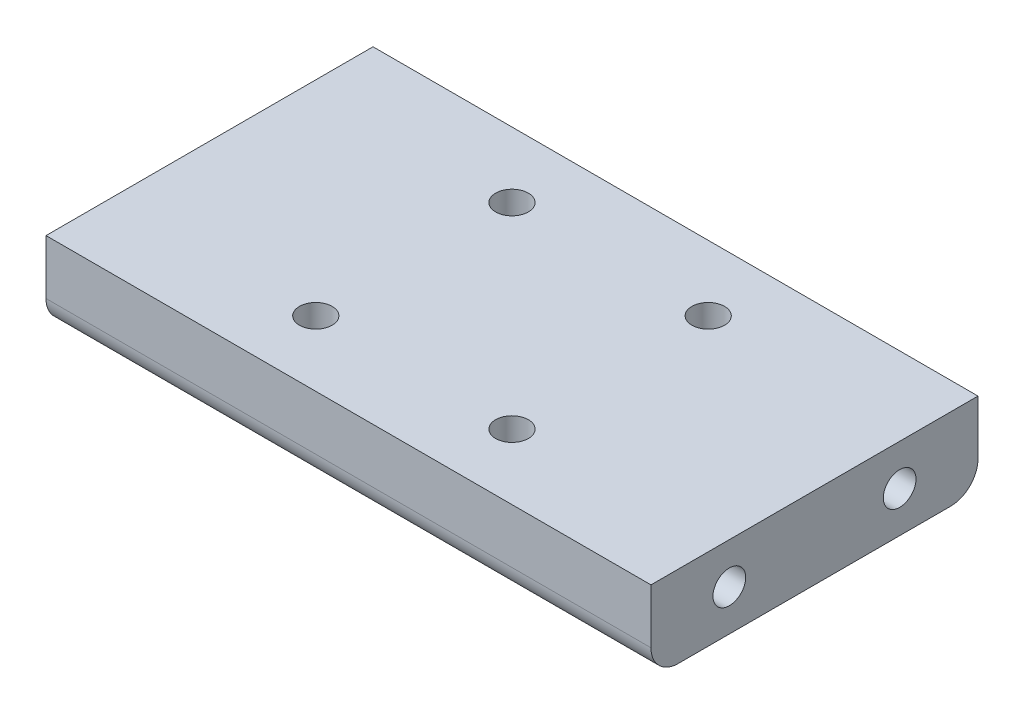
from build123d import *

# Parameters (mm, degrees)
SKETCH4_W           = 111
SKETCH4_H           = 60
BOSS_EXTRUDE2_DEPTH = 15
SKETCH5_R           = 3
CUT_EXTRUDE1_DEPTH  = 10
SKETCH5_4_R         = 3
CUT_EXTRUDE2_DEPTH  = 10
FILLET2_R           = 5
FILLET3_R           = 5
SKETCH7_R           = 3
CUT_EXTRUDE3_DEPTH  = 65.847898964


with BuildPart() as part:
    # Sketch4 → Boss-Extrude2 (new body)
    with BuildSketch(Plane(origin=(0, 0, 0), x_dir=(1, 0, 0), z_dir=(0, 1, 0))):
        Rectangle(SKETCH4_W, SKETCH4_H)
    extrude(amount=BOSS_EXTRUDE2_DEPTH)

    # Sketch5 → Cut-Extrude1 (cut)
    with BuildSketch(Plane(origin=(55.5, 0, 0), x_dir=(0, 0, -1), z_dir=(1, 0, 0))):
        with Locations((-15.625, 7.5)):
            Circle(SKETCH5_R)
    cut_extrude1 = extrude(amount=-CUT_EXTRUDE1_DEPTH, mode=Mode.SUBTRACT)

    # Sketch5_4 → Cut-Extrude2 (cut)
    with BuildSketch(Plane(origin=(55.5, 0, 0), x_dir=(0, 0, -1), z_dir=(1, 0, 0))):
        with Locations((15.625, 7.5)):
            Circle(SKETCH5_4_R)
    cut_extrude2 = extrude(amount=-CUT_EXTRUDE2_DEPTH, mode=Mode.SUBTRACT)

    # Mirror1: Cut-Extrude1, Cut-Extrude2 across plane
    add(cut_extrude1.mirror(Plane(origin=(0, 0, 0), x_dir=(0, 0, 1), z_dir=(1, 0, 0))), mode=Mode.SUBTRACT)
    add(cut_extrude2.mirror(Plane(origin=(0, 0, 0), x_dir=(0, 0, 1), z_dir=(1, 0, 0))), mode=Mode.SUBTRACT)

    # Fillet2
    fillet2_edges = [part.edges().sort_by_distance(p)[0] for p in [
        (0, 0, 30),
    ]]
    fillet(fillet2_edges, radius=FILLET2_R)

    # Fillet3
    fillet3_edges = [part.edges().sort_by_distance(p)[0] for p in [
        (0, 0, -30),
    ]]
    fillet(fillet3_edges, radius=FILLET3_R)

    # Sketch7 → Cut-Extrude3 (cut, through all)
    with BuildSketch(Plane(origin=(0, 15, 0), x_dir=(1, 0, 0), z_dir=(0, 1, 0))):
        with Locations(Location((-18, -18, 0), (0, 0, 270))):
            Circle(SKETCH7_R)
        with Locations(Location((-18, 18, 0), (0, 0, 270))):
            Circle(SKETCH7_R)
        with Locations(Location((18, 18, 0), (0, 0, 270))):
            Circle(SKETCH7_R)
        with Locations(Location((18, -18, 0), (0, 0, 270))):
            Circle(SKETCH7_R)
    extrude(amount=-CUT_EXTRUDE3_DEPTH, mode=Mode.SUBTRACT)


solid = part.part
